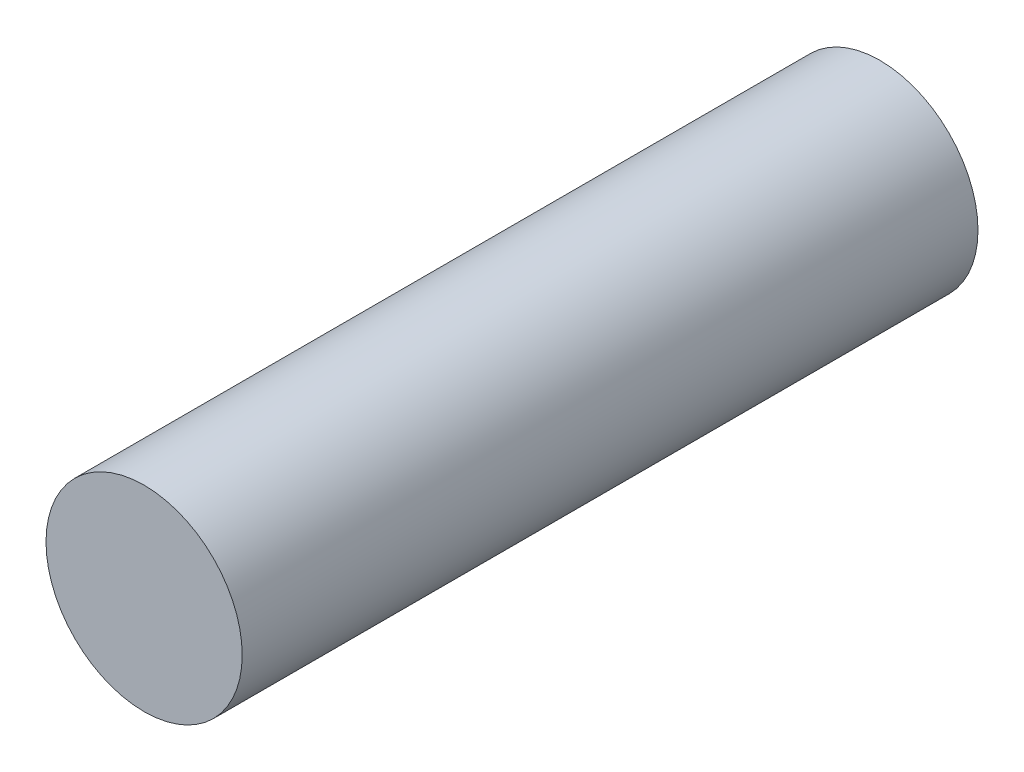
from build123d import *

# Parameters (mm, degrees)
ESQUISSE1_R      = 2
EXTRUSION1_DEPTH = 15


with BuildPart() as part:
    # Esquisse1 → Extrusion1 (new body)
    with BuildSketch(Plane.XY):
        Circle(ESQUISSE1_R)
    extrude(amount=-EXTRUSION1_DEPTH)


solid = part.part
